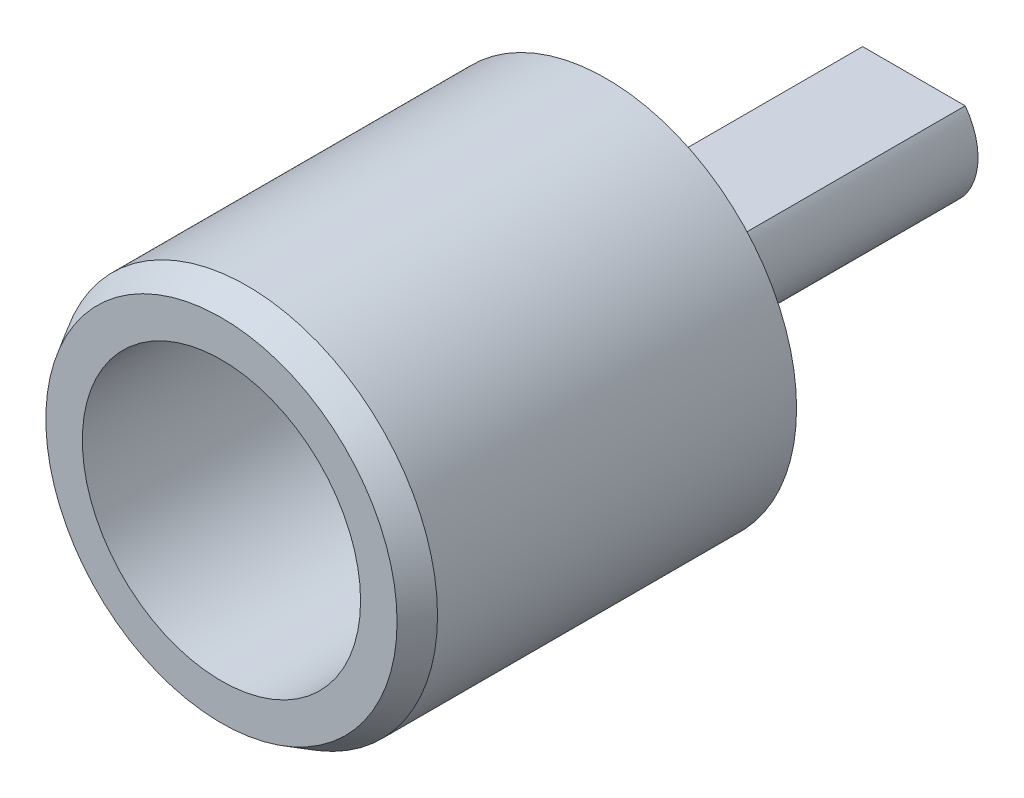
ISO-10303-21;
HEADER;
FILE_DESCRIPTION(('STEP AP214'),'2;1');
FILE_NAME('part.step','',(''),(''),'','','');
FILE_SCHEMA(('AUTOMOTIVE_DESIGN { 1 0 10303 214 1 1 1 1 }'));
ENDSEC;
DATA;
#1=APPLICATION_CONTEXT('core data for automotive mechanical design processes');
#2=APPLICATION_PROTOCOL_DEFINITION('international standard','automotive_design',2000,#1);
#3=PRODUCT_CONTEXT('',#1,'mechanical');
#4=PRODUCT('Part','Part','',(#3));
#5=PRODUCT_RELATED_PRODUCT_CATEGORY('part','',(#4));
#6=PRODUCT_DEFINITION_FORMATION('','',#4);
#7=PRODUCT_DEFINITION_CONTEXT('part definition',#1,'design');
#8=PRODUCT_DEFINITION('design','',#6,#7);
#9=PRODUCT_DEFINITION_SHAPE('','',#8);
#10=(LENGTH_UNIT() NAMED_UNIT(*) SI_UNIT(.MILLI.,.METRE.));
#11=(NAMED_UNIT(*) PLANE_ANGLE_UNIT() SI_UNIT($,.RADIAN.));
#12=(NAMED_UNIT(*) SI_UNIT($,.STERADIAN.) SOLID_ANGLE_UNIT());
#13=UNCERTAINTY_MEASURE_WITH_UNIT(LENGTH_MEASURE(1.E-05),#10,'distance_accuracy_value','');
#14=(GEOMETRIC_REPRESENTATION_CONTEXT(3) GLOBAL_UNCERTAINTY_ASSIGNED_CONTEXT((#13)) GLOBAL_UNIT_ASSIGNED_CONTEXT((#10,
#11,#12)) REPRESENTATION_CONTEXT('',''));
#15=CARTESIAN_POINT('',(0.,0.,0.));
#16=DIRECTION('',(0.,0.,1.));
#17=DIRECTION('',(1.,0.,0.));
#18=AXIS2_PLACEMENT_3D('',#15,#16,#17);
#19=CARTESIAN_POINT('',(0.,0.,-12.));
#20=DIRECTION('',(0.,0.,1.));
#21=DIRECTION('',(1.,0.,0.));
#22=AXIS2_PLACEMENT_3D('',#19,#20,#21);
#23=CYLINDRICAL_SURFACE('',#22,2.5);
#24=CARTESIAN_POINT('',(0.,0.,0.));
#25=DIRECTION('',(0.,0.,1.));
#26=DIRECTION('',(1.,0.,0.));
#27=AXIS2_PLACEMENT_3D('',#24,#25,#26);
#28=CIRCLE('',#27,2.5);
#29=CARTESIAN_POINT('',(-2.,1.5,0.));
#30=VERTEX_POINT('',#29);
#31=CARTESIAN_POINT('',(2.,1.5,0.));
#32=VERTEX_POINT('',#31);
#33=EDGE_CURVE('E73',#30,#32,#28,.T.);
#34=ORIENTED_EDGE('',*,*,#33,.F.);
#35=DIRECTION('',(0.,0.,1.));
#36=VECTOR('',#35,1.);
#37=CARTESIAN_POINT('',(-2.,1.5,-12.));
#38=LINE('',#37,#36);
#39=CARTESIAN_POINT('',(-2.,1.5,-12.));
#40=VERTEX_POINT('',#39);
#41=EDGE_CURVE('E65',#40,#30,#38,.T.);
#42=ORIENTED_EDGE('',*,*,#41,.F.);
#43=CARTESIAN_POINT('',(0.,0.,-12.));
#44=DIRECTION('',(0.,0.,1.));
#45=DIRECTION('',(1.,0.,0.));
#46=AXIS2_PLACEMENT_3D('',#43,#44,#45);
#47=CIRCLE('',#46,2.5);
#48=CARTESIAN_POINT('',(2.,1.5,-12.));
#49=VERTEX_POINT('',#48);
#50=EDGE_CURVE('E76',#40,#49,#47,.T.);
#51=ORIENTED_EDGE('',*,*,#50,.T.);
#52=DIRECTION('',(0.,0.,1.));
#53=VECTOR('',#52,1.);
#54=CARTESIAN_POINT('',(2.,1.5,-12.));
#55=LINE('',#54,#53);
#56=EDGE_CURVE('E74',#49,#32,#55,.T.);
#57=ORIENTED_EDGE('',*,*,#56,.T.);
#58=EDGE_LOOP('',(#34,#42,#51,#57));
#59=FACE_BOUND('',#58,.T.);
#60=ADVANCED_FACE('F47',(#59),#23,.T.);
#61=CARTESIAN_POINT('',(-2.,1.5,-12.));
#62=DIRECTION('',(0.,1.,0.));
#63=DIRECTION('',(0.,0.,1.));
#64=AXIS2_PLACEMENT_3D('',#61,#62,#63);
#65=PLANE('',#64);
#66=DIRECTION('',(-1.,0.,0.));
#67=VECTOR('',#66,1.);
#68=CARTESIAN_POINT('',(-2.,1.5,0.));
#69=LINE('',#68,#67);
#70=EDGE_CURVE('E84',#32,#30,#69,.T.);
#71=ORIENTED_EDGE('',*,*,#70,.F.);
#72=ORIENTED_EDGE('',*,*,#56,.F.);
#73=DIRECTION('',(-1.,0.,0.));
#74=VECTOR('',#73,1.);
#75=CARTESIAN_POINT('',(-2.,1.5,-12.));
#76=LINE('',#75,#74);
#77=EDGE_CURVE('E81',#49,#40,#76,.T.);
#78=ORIENTED_EDGE('',*,*,#77,.T.);
#79=ORIENTED_EDGE('',*,*,#41,.T.);
#80=EDGE_LOOP('',(#71,#72,#78,#79));
#81=FACE_BOUND('',#80,.T.);
#82=ADVANCED_FACE('F85',(#81),#65,.T.);
#83=CARTESIAN_POINT('',(0.,0.,-12.));
#84=DIRECTION('',(0.,0.,1.));
#85=DIRECTION('',(1.,0.,0.));
#86=AXIS2_PLACEMENT_3D('',#83,#84,#85);
#87=PLANE('',#86);
#88=ORIENTED_EDGE('',*,*,#50,.F.);
#89=ORIENTED_EDGE('',*,*,#77,.F.);
#90=EDGE_LOOP('',(#88,#89));
#91=FACE_BOUND('',#90,.T.);
#92=ADVANCED_FACE('F122',(#91),#87,.F.);
#93=CARTESIAN_POINT('',(0.,0.,0.));
#94=DIRECTION('',(0.,0.,1.));
#95=DIRECTION('',(1.,0.,0.));
#96=AXIS2_PLACEMENT_3D('',#93,#94,#95);
#97=PLANE('',#96);
#98=CARTESIAN_POINT('',(0.,0.,0.));
#99=DIRECTION('',(0.,0.,1.));
#100=DIRECTION('',(1.,0.,0.));
#101=AXIS2_PLACEMENT_3D('',#98,#99,#100);
#102=CIRCLE('',#101,7.425);
#103=CARTESIAN_POINT('',(7.425,0.,0.));
#104=VERTEX_POINT('',#103);
#105=EDGE_CURVE('E91',#104,#104,#102,.T.);
#106=ORIENTED_EDGE('',*,*,#105,.F.);
#107=EDGE_LOOP('',(#106));
#108=FACE_BOUND('',#107,.T.);
#109=ORIENTED_EDGE('',*,*,#70,.T.);
#110=ORIENTED_EDGE('',*,*,#33,.T.);
#111=EDGE_LOOP('',(#109,#110));
#112=FACE_BOUND('',#111,.T.);
#113=ADVANCED_FACE('F89',(#108,#112),#97,.F.);
#114=CARTESIAN_POINT('',(0.,0.,15.));
#115=DIRECTION('',(0.,0.,-1.));
#116=DIRECTION('',(-1.,0.,0.));
#117=AXIS2_PLACEMENT_3D('',#114,#115,#116);
#118=CYLINDRICAL_SURFACE('',#117,7.425);
#119=CARTESIAN_POINT('',(0.,0.,14.));
#120=DIRECTION('',(0.,0.,1.));
#121=DIRECTION('',(1.,0.,0.));
#122=AXIS2_PLACEMENT_3D('',#119,#120,#121);
#123=CIRCLE('',#122,7.425);
#124=CARTESIAN_POINT('',(7.425,0.,14.));
#125=VERTEX_POINT('',#124);
#126=EDGE_CURVE('E11',#125,#125,#123,.F.);
#127=ORIENTED_EDGE('',*,*,#126,.T.);
#128=EDGE_LOOP('',(#127));
#129=FACE_BOUND('',#128,.T.);
#130=ORIENTED_EDGE('',*,*,#105,.T.);
#131=EDGE_LOOP('',(#130));
#132=FACE_BOUND('',#131,.T.);
#133=ADVANCED_FACE('F128',(#129,#132),#118,.T.);
#134=CARTESIAN_POINT('',(0.,0.,15.));
#135=DIRECTION('',(0.,0.,1.));
#136=DIRECTION('',(1.,0.,0.));
#137=AXIS2_PLACEMENT_3D('',#134,#135,#136);
#138=PLANE('',#137);
#139=CARTESIAN_POINT('',(0.,0.,15.));
#140=DIRECTION('',(0.,0.,1.));
#141=DIRECTION('',(1.,0.,0.));
#142=AXIS2_PLACEMENT_3D('',#139,#140,#141);
#143=CIRCLE('',#142,6.84764973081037);
#144=CARTESIAN_POINT('',(6.84764973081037,0.,15.));
#145=VERTEX_POINT('',#144);
#146=EDGE_CURVE('E58',#145,#145,#143,.T.);
#147=ORIENTED_EDGE('',*,*,#146,.T.);
#148=EDGE_LOOP('',(#147));
#149=FACE_BOUND('',#148,.T.);
#150=CARTESIAN_POINT('',(0.,0.,15.));
#151=DIRECTION('',(0.,0.,1.));
#152=DIRECTION('',(1.,0.,0.));
#153=AXIS2_PLACEMENT_3D('',#150,#151,#152);
#154=CIRCLE('',#153,5.425);
#155=CARTESIAN_POINT('',(5.425,0.,15.));
#156=VERTEX_POINT('',#155);
#157=EDGE_CURVE('E146',#156,#156,#154,.T.);
#158=ORIENTED_EDGE('',*,*,#157,.F.);
#159=EDGE_LOOP('',(#158));
#160=FACE_BOUND('',#159,.T.);
#161=ADVANCED_FACE('F105',(#149,#160),#138,.T.);
#162=CARTESIAN_POINT('',(0.,0.,0.499999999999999));
#163=DIRECTION('',(0.,0.,1.));
#164=DIRECTION('',(1.,0.,0.));
#165=AXIS2_PLACEMENT_3D('',#162,#163,#164);
#166=CYLINDRICAL_SURFACE('',#165,5.425);
#167=CARTESIAN_POINT('',(0.,0.,0.499999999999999));
#168=DIRECTION('',(0.,0.,1.));
#169=DIRECTION('',(1.,0.,0.));
#170=AXIS2_PLACEMENT_3D('',#167,#168,#169);
#171=CIRCLE('',#170,5.425);
#172=CARTESIAN_POINT('',(5.425,0.,0.499999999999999));
#173=VERTEX_POINT('',#172);
#174=EDGE_CURVE('E95',#173,#173,#171,.T.);
#175=CARTESIAN_POINT('',(5.425,0.,0.499999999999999));
#176=CARTESIAN_POINT('',(5.425,0.,0.651041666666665));
#177=CARTESIAN_POINT('',(5.425,0.,0.802083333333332));
#178=CARTESIAN_POINT('',(5.425,0.,1.10416666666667));
#179=CARTESIAN_POINT('',(5.425,0.,1.25520833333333));
#180=CARTESIAN_POINT('',(5.425,0.,1.55729166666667));
#181=CARTESIAN_POINT('',(5.425,0.,1.70833333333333));
#182=CARTESIAN_POINT('',(5.425,0.,2.01041666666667));
#183=CARTESIAN_POINT('',(5.425,0.,2.16145833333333));
#184=CARTESIAN_POINT('',(5.425,0.,2.46354166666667));
#185=CARTESIAN_POINT('',(5.425,0.,2.61458333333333));
#186=CARTESIAN_POINT('',(5.425,0.,2.91666666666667));
#187=CARTESIAN_POINT('',(5.425,0.,3.06770833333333));
#188=CARTESIAN_POINT('',(5.425,0.,3.36979166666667));
#189=CARTESIAN_POINT('',(5.425,0.,3.52083333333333));
#190=CARTESIAN_POINT('',(5.425,0.,3.82291666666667));
#191=CARTESIAN_POINT('',(5.425,0.,3.97395833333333));
#192=CARTESIAN_POINT('',(5.425,0.,4.27604166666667));
#193=CARTESIAN_POINT('',(5.425,0.,4.42708333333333));
#194=CARTESIAN_POINT('',(5.425,0.,4.72916666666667));
#195=CARTESIAN_POINT('',(5.425,0.,4.88020833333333));
#196=CARTESIAN_POINT('',(5.425,0.,5.18229166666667));
#197=CARTESIAN_POINT('',(5.425,0.,5.33333333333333));
#198=CARTESIAN_POINT('',(5.425,0.,5.63541666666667));
#199=CARTESIAN_POINT('',(5.425,0.,5.78645833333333));
#200=CARTESIAN_POINT('',(5.425,0.,6.08854166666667));
#201=CARTESIAN_POINT('',(5.425,0.,6.23958333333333));
#202=CARTESIAN_POINT('',(5.425,0.,6.54166666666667));
#203=CARTESIAN_POINT('',(5.425,0.,6.69270833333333));
#204=CARTESIAN_POINT('',(5.425,0.,6.99479166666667));
#205=CARTESIAN_POINT('',(5.425,0.,7.14583333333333));
#206=CARTESIAN_POINT('',(5.425,0.,7.44791666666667));
#207=CARTESIAN_POINT('',(5.425,0.,7.59895833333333));
#208=CARTESIAN_POINT('',(5.425,0.,7.90104166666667));
#209=CARTESIAN_POINT('',(5.425,0.,8.05208333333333));
#210=CARTESIAN_POINT('',(5.425,0.,8.35416666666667));
#211=CARTESIAN_POINT('',(5.425,0.,8.50520833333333));
#212=CARTESIAN_POINT('',(5.425,0.,8.80729166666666));
#213=CARTESIAN_POINT('',(5.425,0.,8.95833333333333));
#214=CARTESIAN_POINT('',(5.425,0.,9.26041666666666));
#215=CARTESIAN_POINT('',(5.425,0.,9.41145833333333));
#216=CARTESIAN_POINT('',(5.425,0.,9.71354166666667));
#217=CARTESIAN_POINT('',(5.425,0.,9.86458333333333));
#218=CARTESIAN_POINT('',(5.425,0.,10.1666666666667));
#219=CARTESIAN_POINT('',(5.425,0.,10.3177083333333));
#220=CARTESIAN_POINT('',(5.425,0.,10.6197916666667));
#221=CARTESIAN_POINT('',(5.425,0.,10.7708333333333));
#222=CARTESIAN_POINT('',(5.425,0.,11.0729166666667));
#223=CARTESIAN_POINT('',(5.425,0.,11.2239583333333));
#224=CARTESIAN_POINT('',(5.425,0.,11.5260416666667));
#225=CARTESIAN_POINT('',(5.425,0.,11.6770833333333));
#226=CARTESIAN_POINT('',(5.425,0.,11.9791666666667));
#227=CARTESIAN_POINT('',(5.425,0.,12.1302083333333));
#228=CARTESIAN_POINT('',(5.425,0.,12.4322916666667));
#229=CARTESIAN_POINT('',(5.425,0.,12.5833333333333));
#230=CARTESIAN_POINT('',(5.425,0.,12.8854166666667));
#231=CARTESIAN_POINT('',(5.425,0.,13.0364583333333));
#232=CARTESIAN_POINT('',(5.425,0.,13.3385416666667));
#233=CARTESIAN_POINT('',(5.425,0.,13.4895833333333));
#234=CARTESIAN_POINT('',(5.425,0.,13.7916666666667));
#235=CARTESIAN_POINT('',(5.425,0.,13.9427083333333));
#236=CARTESIAN_POINT('',(5.425,0.,14.2447916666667));
#237=CARTESIAN_POINT('',(5.425,0.,14.3958333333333));
#238=CARTESIAN_POINT('',(5.425,0.,14.6979166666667));
#239=CARTESIAN_POINT('',(5.425,0.,14.8489583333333));
#240=CARTESIAN_POINT('',(5.425,0.,15.));
#241=B_SPLINE_CURVE_WITH_KNOTS('',3,(#175,#176,#177,#178,#179,#180,#181,#182,#183,#184,#185,
#186,#187,#188,#189,#190,#191,#192,#193,#194,#195,#196,#197,#198,#199,#200,#201,#202,#203,#204,
#205,#206,#207,#208,#209,#210,#211,#212,#213,#214,#215,#216,#217,#218,#219,#220,#221,#222,#223,
#224,#225,#226,#227,#228,#229,#230,#231,#232,#233,#234,#235,#236,#237,#238,#239,#240),
.UNSPECIFIED.,.F.,.F.,(4,2,2,2,2,2,2,2,2,2,2,2,2,2,2,2,2,2,2,2,2,2,2,2,2,2,2,2,2,2,2,2,4),(0.,
0.453125,0.90625,1.359375,1.8125,2.265625,2.71875,3.171875,3.625,4.078125,4.53125,4.984375,
5.4375,5.890625,6.34375,6.796875,7.25,7.703125,8.15625,8.609375,9.0625,9.515625,9.96875,
10.421875,10.875,11.328125,11.78125,12.234375,12.6875,13.140625,13.59375,14.046875,14.5),.UNSPECIFIED.);
#242=EDGE_CURVE('BSEAM114',#173,#156,#241,.T.);
#243=ORIENTED_EDGE('',*,*,#174,.F.);
#244=ORIENTED_EDGE('',*,*,#157,.T.);
#245=ORIENTED_EDGE('',*,*,#242,.T.);
#246=ORIENTED_EDGE('',*,*,#242,.F.);
#247=EDGE_LOOP('',(#243,#245,#244,#246));
#248=FACE_BOUND('',#247,.T.);
#249=ADVANCED_FACE('F114',(#248),#166,.F.);
#250=CARTESIAN_POINT('',(0.,0.,0.499999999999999));
#251=DIRECTION('',(0.,0.,1.));
#252=DIRECTION('',(1.,0.,0.));
#253=AXIS2_PLACEMENT_3D('',#250,#251,#252);
#254=PLANE('',#253);
#255=ORIENTED_EDGE('',*,*,#174,.T.);
#256=EDGE_LOOP('',(#255));
#257=FACE_BOUND('',#256,.T.);
#258=ADVANCED_FACE('F109',(#257),#254,.T.);
#259=CARTESIAN_POINT('',(0.,0.,15.));
#260=DIRECTION('',(0.,0.,-1.));
#261=DIRECTION('',(-1.,0.,0.));
#262=AXIS2_PLACEMENT_3D('',#259,#260,#261);
#263=CONICAL_SURFACE('',#262,6.84764973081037,0.523598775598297);
#264=ORIENTED_EDGE('',*,*,#126,.F.);
#265=EDGE_LOOP('',(#264));
#266=FACE_BOUND('',#265,.T.);
#267=ORIENTED_EDGE('',*,*,#146,.F.);
#268=EDGE_LOOP('',(#267));
#269=FACE_BOUND('',#268,.T.);
#270=ADVANCED_FACE('F50',(#266,#269),#263,.T.);
#271=CLOSED_SHELL('',(#60,#82,#92,#113,#133,#161,#249,#258,#270));
#272=MANIFOLD_SOLID_BREP('B2',#271);
#273=ADVANCED_BREP_SHAPE_REPRESENTATION('',(#18,#272),#14);
#274=SHAPE_DEFINITION_REPRESENTATION(#9,#273);
ENDSEC;
END-ISO-10303-21;
